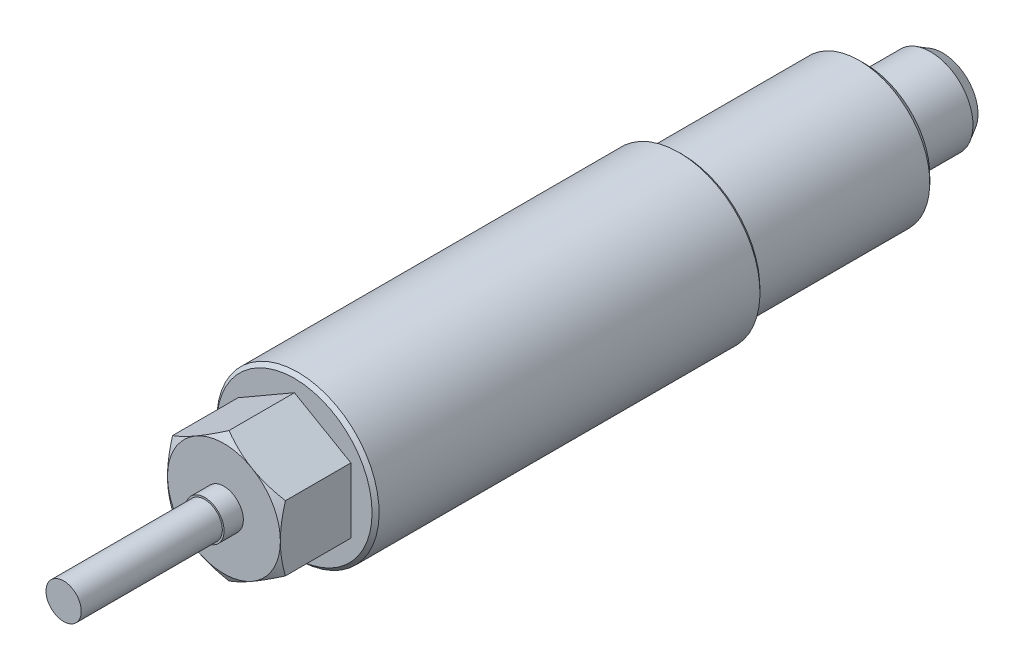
ISO-10303-21;
HEADER;
FILE_DESCRIPTION(('STEP AP214'),'2;1');
FILE_NAME('part.step','',(''),(''),'','','');
FILE_SCHEMA(('AUTOMOTIVE_DESIGN { 1 0 10303 214 1 1 1 1 }'));
ENDSEC;
DATA;
#1=APPLICATION_CONTEXT('core data for automotive mechanical design processes');
#2=APPLICATION_PROTOCOL_DEFINITION('international standard','automotive_design',2000,#1);
#3=PRODUCT_CONTEXT('',#1,'mechanical');
#4=PRODUCT('Part','Part','',(#3));
#5=PRODUCT_RELATED_PRODUCT_CATEGORY('part','',(#4));
#6=PRODUCT_DEFINITION_FORMATION('','',#4);
#7=PRODUCT_DEFINITION_CONTEXT('part definition',#1,'design');
#8=PRODUCT_DEFINITION('design','',#6,#7);
#9=PRODUCT_DEFINITION_SHAPE('','',#8);
#10=(LENGTH_UNIT() NAMED_UNIT(*) SI_UNIT(.MILLI.,.METRE.));
#11=(NAMED_UNIT(*) PLANE_ANGLE_UNIT() SI_UNIT($,.RADIAN.));
#12=(NAMED_UNIT(*) SI_UNIT($,.STERADIAN.) SOLID_ANGLE_UNIT());
#13=UNCERTAINTY_MEASURE_WITH_UNIT(LENGTH_MEASURE(1.E-05),#10,'distance_accuracy_value','');
#14=(GEOMETRIC_REPRESENTATION_CONTEXT(3) GLOBAL_UNCERTAINTY_ASSIGNED_CONTEXT((#13)) GLOBAL_UNIT_ASSIGNED_CONTEXT((#10,
#11,#12)) REPRESENTATION_CONTEXT('',''));
#15=CARTESIAN_POINT('',(0.,0.,0.));
#16=DIRECTION('',(0.,0.,1.));
#17=DIRECTION('',(1.,0.,0.));
#18=AXIS2_PLACEMENT_3D('',#15,#16,#17);
#19=CARTESIAN_POINT('',(0.,0.,81.));
#20=DIRECTION('',(0.,0.,-1.));
#21=DIRECTION('',(0.,1.,0.));
#22=AXIS2_PLACEMENT_3D('',#19,#20,#21);
#23=CONICAL_SURFACE('',#22,11.,0.785398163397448);
#24=CARTESIAN_POINT('',(0.,0.,80.5));
#25=DIRECTION('',(0.,0.,-1.));
#26=DIRECTION('',(0.,1.,0.));
#27=AXIS2_PLACEMENT_3D('',#24,#25,#26);
#28=CIRCLE('',#27,11.5);
#29=CARTESIAN_POINT('',(0.,11.5,80.5));
#30=VERTEX_POINT('',#29);
#31=EDGE_CURVE('E151',#30,#30,#28,.T.);
#32=ORIENTED_EDGE('',*,*,#31,.F.);
#33=EDGE_LOOP('',(#32));
#34=FACE_BOUND('',#33,.T.);
#35=CARTESIAN_POINT('',(0.,0.,81.));
#36=DIRECTION('',(0.,0.,1.));
#37=DIRECTION('',(0.,-1.,0.));
#38=AXIS2_PLACEMENT_3D('',#35,#36,#37);
#39=CIRCLE('',#38,11.);
#40=CARTESIAN_POINT('',(0.,-11.,81.));
#41=VERTEX_POINT('',#40);
#42=EDGE_CURVE('E120',#41,#41,#39,.T.);
#43=ORIENTED_EDGE('',*,*,#42,.F.);
#44=EDGE_LOOP('',(#43));
#45=FACE_BOUND('',#44,.T.);
#46=ADVANCED_FACE('F14',(#34,#45),#23,.T.);
#47=CARTESIAN_POINT('',(0.,0.,0.));
#48=DIRECTION('',(0.,0.,-1.));
#49=DIRECTION('',(0.,1.,0.));
#50=AXIS2_PLACEMENT_3D('',#47,#48,#49);
#51=CYLINDRICAL_SURFACE('',#50,11.5);
#52=CARTESIAN_POINT('',(0.,0.,26.5));
#53=DIRECTION('',(0.,0.,-1.));
#54=DIRECTION('',(0.,1.,0.));
#55=AXIS2_PLACEMENT_3D('',#52,#53,#54);
#56=CIRCLE('',#55,11.5);
#57=CARTESIAN_POINT('',(0.,11.5,26.5));
#58=VERTEX_POINT('',#57);
#59=EDGE_CURVE('E148',#58,#58,#56,.T.);
#60=ORIENTED_EDGE('',*,*,#59,.F.);
#61=EDGE_LOOP('',(#60));
#62=FACE_BOUND('',#61,.T.);
#63=ORIENTED_EDGE('',*,*,#31,.T.);
#64=EDGE_LOOP('',(#63));
#65=FACE_BOUND('',#64,.T.);
#66=ADVANCED_FACE('F218',(#62,#65),#51,.T.);
#67=CARTESIAN_POINT('',(0.,0.,26.5));
#68=DIRECTION('',(0.,0.,1.));
#69=DIRECTION('',(0.,-1.,0.));
#70=AXIS2_PLACEMENT_3D('',#67,#68,#69);
#71=CONICAL_SURFACE('',#70,11.5,0.785398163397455);
#72=CARTESIAN_POINT('',(0.,0.,26.));
#73=DIRECTION('',(0.,0.,-1.));
#74=DIRECTION('',(0.,1.,0.));
#75=AXIS2_PLACEMENT_3D('',#72,#73,#74);
#76=CIRCLE('',#75,11.);
#77=CARTESIAN_POINT('',(0.,11.,26.));
#78=VERTEX_POINT('',#77);
#79=EDGE_CURVE('E145',#78,#78,#76,.T.);
#80=ORIENTED_EDGE('',*,*,#79,.F.);
#81=EDGE_LOOP('',(#80));
#82=FACE_BOUND('',#81,.T.);
#83=ORIENTED_EDGE('',*,*,#59,.T.);
#84=EDGE_LOOP('',(#83));
#85=FACE_BOUND('',#84,.T.);
#86=ADVANCED_FACE('F214',(#82,#85),#71,.T.);
#87=CARTESIAN_POINT('',(11.,0.,26.));
#88=DIRECTION('',(0.,0.,1.));
#89=DIRECTION('',(0.,-1.,0.));
#90=AXIS2_PLACEMENT_3D('',#87,#88,#89);
#91=PLANE('',#90);
#92=CARTESIAN_POINT('',(0.,0.,26.));
#93=DIRECTION('',(0.,0.,-1.));
#94=DIRECTION('',(0.,1.,0.));
#95=AXIS2_PLACEMENT_3D('',#92,#93,#94);
#96=CIRCLE('',#95,10.);
#97=CARTESIAN_POINT('',(0.,10.,26.));
#98=VERTEX_POINT('',#97);
#99=EDGE_CURVE('E142',#98,#98,#96,.T.);
#100=ORIENTED_EDGE('',*,*,#99,.F.);
#101=EDGE_LOOP('',(#100));
#102=FACE_BOUND('',#101,.T.);
#103=ORIENTED_EDGE('',*,*,#79,.T.);
#104=EDGE_LOOP('',(#103));
#105=FACE_BOUND('',#104,.T.);
#106=ADVANCED_FACE('F211',(#102,#105),#91,.F.);
#107=CARTESIAN_POINT('',(-8.,4.61880215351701,81.));
#108=DIRECTION('',(-1.,0.,0.));
#109=DIRECTION('',(0.,-1.,0.));
#110=AXIS2_PLACEMENT_3D('',#107,#108,#109);
#111=PLANE('',#110);
#112=CARTESIAN_POINT('',(-8.,12.5536073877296,87.0243648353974));
#113=CARTESIAN_POINT('',(-8.,12.202944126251,87.1950535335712));
#114=CARTESIAN_POINT('',(-8.,11.851491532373,87.3641476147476));
#115=CARTESIAN_POINT('',(-8.,11.1465884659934,87.6982525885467));
#116=CARTESIAN_POINT('',(-8.,10.7931377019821,87.8632628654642));
#117=CARTESIAN_POINT('',(-8.,10.0820673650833,88.189105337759));
#118=CARTESIAN_POINT('',(-8.,9.72443565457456,88.3499111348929));
#119=CARTESIAN_POINT('',(-8.,9.00637889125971,88.6651358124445));
#120=CARTESIAN_POINT('',(-8.,8.64595396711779,88.8195549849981));
#121=CARTESIAN_POINT('',(-8.,7.90953345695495,89.1253935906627));
#122=CARTESIAN_POINT('',(-8.,7.53342244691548,89.2765365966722));
#123=CARTESIAN_POINT('',(-8.,6.77685561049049,89.5677353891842));
#124=CARTESIAN_POINT('',(-8.,6.39639930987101,89.7077899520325));
#125=CARTESIAN_POINT('',(-8.,5.63119795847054,89.9732419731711));
#126=CARTESIAN_POINT('',(-8.,5.24646288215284,90.0986678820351));
#127=CARTESIAN_POINT('',(-8.,4.47148883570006,90.3309365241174));
#128=CARTESIAN_POINT('',(-8.,4.08125159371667,90.4377849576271));
#129=CARTESIAN_POINT('',(-8.,3.29719320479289,90.6272837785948));
#130=CARTESIAN_POINT('',(-8.,2.90340610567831,90.7100712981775));
#131=CARTESIAN_POINT('',(-8.,2.30902459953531,90.8127022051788));
#132=CARTESIAN_POINT('',(-8.,2.1102670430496,90.8433221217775));
#133=CARTESIAN_POINT('',(-8.,1.71171483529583,90.8967817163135));
#134=CARTESIAN_POINT('',(-8.,1.51192028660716,90.9196221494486));
#135=CARTESIAN_POINT('',(-8.,1.11423554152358,90.9567734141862));
#136=CARTESIAN_POINT('',(-8.,0.916355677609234,90.9711943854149));
#137=CARTESIAN_POINT('',(-8.,0.520162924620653,90.9916487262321));
#138=CARTESIAN_POINT('',(-8.,0.32185004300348,90.9976822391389));
#139=CARTESIAN_POINT('',(-8.,-0.0748530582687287,91.0012171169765));
#140=CARTESIAN_POINT('',(-8.,-0.273243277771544,90.9987184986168));
#141=CARTESIAN_POINT('',(-8.,-0.669738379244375,90.9852520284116));
#142=CARTESIAN_POINT('',(-8.,-0.867843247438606,90.9742837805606));
#143=CARTESIAN_POINT('',(-8.,-1.33957431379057,90.9383175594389));
#144=CARTESIAN_POINT('',(-8.,-1.61291917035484,90.9095444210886));
#145=CARTESIAN_POINT('',(-8.,-2.15766264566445,90.8374103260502));
#146=CARTESIAN_POINT('',(-8.,-2.42906101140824,90.7940475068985));
#147=CARTESIAN_POINT('',(-8.,-3.23998071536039,90.6443668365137));
#148=CARTESIAN_POINT('',(-8.,-3.77594268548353,90.5184813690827));
#149=CARTESIAN_POINT('',(-8.,-4.57753225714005,90.2991318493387));
#150=CARTESIAN_POINT('',(-8.,-4.84728942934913,90.2198813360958));
#151=CARTESIAN_POINT('',(-8.,-5.38418667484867,90.0528836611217));
#152=CARTESIAN_POINT('',(-8.,-5.65132672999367,89.9651364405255));
#153=CARTESIAN_POINT('',(-8.,-6.18306845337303,89.7825750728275));
#154=CARTESIAN_POINT('',(-8.,-6.4476708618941,89.6877630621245));
#155=CARTESIAN_POINT('',(-8.,-6.97466590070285,89.4922140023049));
#156=CARTESIAN_POINT('',(-8.,-7.23705856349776,89.3914770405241));
#157=CARTESIAN_POINT('',(-8.,-7.88051669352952,89.1374262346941));
#158=CARTESIAN_POINT('',(-8.,-8.26047059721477,88.9813014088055));
#159=CARTESIAN_POINT('',(-8.,-9.01691952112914,88.6608599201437));
#160=CARTESIAN_POINT('',(-8.,-9.39341427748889,88.4965426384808));
#161=CARTESIAN_POINT('',(-8.,-10.143629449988,88.1614403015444));
#162=CARTESIAN_POINT('',(-8.,-10.5173490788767,87.9906534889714));
#163=CARTESIAN_POINT('',(-8.,-11.262399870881,87.6439867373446));
#164=CARTESIAN_POINT('',(-8.,-11.6337310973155,87.4681069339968));
#165=CARTESIAN_POINT('',(-8.,-12.3748915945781,87.1120269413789));
#166=CARTESIAN_POINT('',(-8.,-12.7447183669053,86.931821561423));
#167=CARTESIAN_POINT('',(-8.,-13.482727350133,86.5680742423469));
#168=CARTESIAN_POINT('',(-8.,-13.8509095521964,86.3845322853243));
#169=CARTESIAN_POINT('',(-8.,-14.5858360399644,86.0147378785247));
#170=CARTESIAN_POINT('',(-8.,-14.9525805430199,85.8284858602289));
#171=CARTESIAN_POINT('',(-8.,-15.6849051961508,85.4537053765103));
#172=CARTESIAN_POINT('',(-8.,-16.0504853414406,85.2651769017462));
#173=CARTESIAN_POINT('',(-8.,-17.079769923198,84.7309870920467));
#174=CARTESIAN_POINT('',(-8.,-17.7423367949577,84.3831340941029));
#175=CARTESIAN_POINT('',(-8.,-19.0650363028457,83.6827725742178));
#176=CARTESIAN_POINT('',(-8.,-19.7251688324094,83.3302638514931));
#177=CARTESIAN_POINT('',(-8.,-21.0416810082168,82.6227203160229));
#178=CARTESIAN_POINT('',(-8.,-21.6980659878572,82.2676954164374));
#179=CARTESIAN_POINT('',(-8.,-23.0092915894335,81.5549019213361));
#180=CARTESIAN_POINT('',(-8.,-23.6641323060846,81.1971335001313));
#181=CARTESIAN_POINT('',(-8.,-24.3184126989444,80.8383511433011));
#182=B_SPLINE_CURVE_WITH_KNOTS('',3,(#112,#113,#114,#115,#116,#117,#118,#119,#120,#121,#122,
#123,#124,#125,#126,#127,#128,#129,#130,#131,#132,#133,#134,#135,#136,#137,#138,#139,#140,#141,
#142,#143,#144,#145,#146,#147,#148,#149,#150,#151,#152,#153,#154,#155,#156,#157,#158,#159,#160,
#161,#162,#163,#164,#165,#166,#167,#168,#169,#170,#171,#172,#173,#174,#175,#176,#177,#178,#179,
#180,#181),.UNSPECIFIED.,.F.,.F.,(4,2,2,2,2,2,2,2,2,2,2,2,2,2,2,2,2,2,2,2,2,2,2,2,2,2,2,2,2,2,2,
2,2,2,4),(0.,1.17001110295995,2.3401975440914,3.51651067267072,4.69276993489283,
5.90866593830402,7.1246959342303,8.33832003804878,9.55157109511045,10.7577653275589,
11.3609441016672,11.9640643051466,12.5591069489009,13.1541394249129,13.7491707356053,
14.3442298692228,15.1683323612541,15.9925400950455,17.6418068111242,18.485205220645,
19.328609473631,20.1717597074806,21.0148975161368,22.2471030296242,23.479401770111,
24.7120376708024,25.9446407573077,27.178805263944,28.4129763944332,29.646953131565,
30.8809349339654,33.1258942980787,35.3709507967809,37.6096830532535,39.8482742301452),.UNSPECIFIED.);
#183=CARTESIAN_POINT('',(-8.,-4.61880215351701,90.2854688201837));
#184=VERTEX_POINT('',#183);
#185=CARTESIAN_POINT('',(-8.,0.,91.));
#186=VERTEX_POINT('',#185);
#187=EDGE_CURVE('E9',#184,#186,#182,.F.);
#188=ORIENTED_EDGE('',*,*,#187,.T.);
#189=CARTESIAN_POINT('',(-8.,4.61880215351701,90.2854688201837));
#190=VERTEX_POINT('',#189);
#191=EDGE_CURVE('E18',#186,#190,#182,.F.);
#192=ORIENTED_EDGE('',*,*,#191,.T.);
#193=DIRECTION('',(0.,0.,1.));
#194=VECTOR('',#193,1.);
#195=CARTESIAN_POINT('',(-8.,4.61880215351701,81.));
#196=LINE('',#195,#194);
#197=CARTESIAN_POINT('',(-8.,4.61880215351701,81.));
#198=VERTEX_POINT('',#197);
#199=EDGE_CURVE('E111',#198,#190,#196,.T.);
#200=ORIENTED_EDGE('',*,*,#199,.F.);
#201=DIRECTION('',(0.,-1.,0.));
#202=VECTOR('',#201,1.);
#203=CARTESIAN_POINT('',(-8.,4.61880215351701,81.));
#204=LINE('',#203,#202);
#205=CARTESIAN_POINT('',(-8.,-4.61880215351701,81.));
#206=VERTEX_POINT('',#205);
#207=EDGE_CURVE('E97',#198,#206,#204,.T.);
#208=ORIENTED_EDGE('',*,*,#207,.T.);
#209=DIRECTION('',(0.,0.,1.));
#210=VECTOR('',#209,1.);
#211=CARTESIAN_POINT('',(-8.,-4.61880215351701,81.));
#212=LINE('',#211,#210);
#213=EDGE_CURVE('E89',#206,#184,#212,.T.);
#214=ORIENTED_EDGE('',*,*,#213,.T.);
#215=EDGE_LOOP('',(#188,#192,#200,#208,#214));
#216=FACE_BOUND('',#215,.T.);
#217=ADVANCED_FACE('F110',(#216),#111,.T.);
#218=CARTESIAN_POINT('',(0.,9.23760430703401,81.));
#219=DIRECTION('',(-0.5,0.866025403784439,0.));
#220=DIRECTION('',(-0.866025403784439,-0.5,0.));
#221=AXIS2_PLACEMENT_3D('',#218,#219,#220);
#222=PLANE('',#221);
#223=CARTESIAN_POINT('',(-8.0002,4.61868668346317,90.285402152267));
#224=CARTESIAN_POINT('',(-7.82435121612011,4.72021302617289,90.3440092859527));
#225=CARTESIAN_POINT('',(-7.64784680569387,4.82211789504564,90.3999565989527));
#226=CARTESIAN_POINT('',(-7.29340453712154,5.02675523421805,90.5057989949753));
#227=CARTESIAN_POINT('',(-7.11546609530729,5.12948804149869,90.5556914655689));
#228=CARTESIAN_POINT('',(-6.57880176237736,5.43933133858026,90.6953072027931));
#229=CARTESIAN_POINT('',(-6.21795741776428,5.64766491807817,90.7747188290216));
#230=CARTESIAN_POINT('',(-5.67796082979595,5.95943209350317,90.8678383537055));
#231=CARTESIAN_POINT('',(-5.50042181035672,6.06193429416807,90.8943654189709));
#232=CARTESIAN_POINT('',(-5.14454088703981,6.26740224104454,90.9388468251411));
#233=CARTESIAN_POINT('',(-4.96619905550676,6.37036794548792,90.9568019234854));
#234=CARTESIAN_POINT('',(-4.60920831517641,6.57647664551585,90.9836843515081));
#235=CARTESIAN_POINT('',(-4.4305599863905,6.67961930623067,90.9926219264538));
#236=CARTESIAN_POINT('',(-4.07309829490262,6.88599991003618,91.0012776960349));
#237=CARTESIAN_POINT('',(-3.89428493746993,6.98923785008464,91.0009961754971));
#238=CARTESIAN_POINT('',(-3.55998663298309,7.18224506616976,90.9918549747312));
#239=CARTESIAN_POINT('',(-3.40447809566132,7.27202796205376,90.9841103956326));
#240=CARTESIAN_POINT('',(-3.09382523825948,7.45138347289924,90.9617988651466));
#241=CARTESIAN_POINT('',(-2.93868094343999,7.54095607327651,90.9472314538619));
#242=CARTESIAN_POINT('',(-2.47384868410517,7.80932710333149,90.8936393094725));
#243=CARTESIAN_POINT('',(-2.16498351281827,7.98765049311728,90.8447313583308));
#244=CARTESIAN_POINT('',(-1.54397677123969,8.34618890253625,90.7224605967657));
#245=CARTESIAN_POINT('',(-1.23191445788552,8.52635816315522,90.648579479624));
#246=CARTESIAN_POINT('',(-0.612443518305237,8.88400987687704,90.480899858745));
#247=CARTESIAN_POINT('',(-0.305026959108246,9.06149691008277,90.3871407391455));
#248=CARTESIAN_POINT('',(0.000199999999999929,9.23771977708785,90.285402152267));
#249=B_SPLINE_CURVE_WITH_KNOTS('',3,(#223,#224,#225,#226,#227,#228,#229,#230,#231,#232,#233,
#234,#235,#236,#237,#238,#239,#240,#241,#242,#243,#244,#245,#246,#247,#248),.UNSPECIFIED.,.F.,
.F.,(4,2,2,2,2,2,2,2,2,2,2,2,4),(0.,0.633973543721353,1.26821965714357,2.53934712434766,
3.15934343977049,3.77928496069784,4.39852133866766,5.01773858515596,5.5568023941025,
6.09590254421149,7.17487077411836,8.27776850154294,9.37850115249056),.UNSPECIFIED.);
#250=CARTESIAN_POINT('',(-4.,6.92820323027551,91.));
#251=VERTEX_POINT('',#250);
#252=EDGE_CURVE('E257',#190,#251,#249,.T.);
#253=ORIENTED_EDGE('',*,*,#252,.T.);
#254=CARTESIAN_POINT('',(0.,9.23760430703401,90.2854688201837));
#255=VERTEX_POINT('',#254);
#256=EDGE_CURVE('E251',#251,#255,#249,.T.);
#257=ORIENTED_EDGE('',*,*,#256,.T.);
#258=DIRECTION('',(0.,0.,1.));
#259=VECTOR('',#258,1.);
#260=CARTESIAN_POINT('',(0.,9.23760430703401,81.));
#261=LINE('',#260,#259);
#262=CARTESIAN_POINT('',(0.,9.23760430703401,81.));
#263=VERTEX_POINT('',#262);
#264=EDGE_CURVE('E121',#263,#255,#261,.T.);
#265=ORIENTED_EDGE('',*,*,#264,.F.);
#266=DIRECTION('',(-0.866025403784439,-0.5,0.));
#267=VECTOR('',#266,1.);
#268=CARTESIAN_POINT('',(0.,9.23760430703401,81.));
#269=LINE('',#268,#267);
#270=EDGE_CURVE('E113',#263,#198,#269,.T.);
#271=ORIENTED_EDGE('',*,*,#270,.T.);
#272=ORIENTED_EDGE('',*,*,#199,.T.);
#273=EDGE_LOOP('',(#253,#257,#265,#271,#272));
#274=FACE_BOUND('',#273,.T.);
#275=ADVANCED_FACE('F244',(#274),#222,.T.);
#276=CARTESIAN_POINT('',(8.,4.61880215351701,81.));
#277=DIRECTION('',(0.5,0.866025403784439,0.));
#278=DIRECTION('',(-0.866025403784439,0.5,0.));
#279=AXIS2_PLACEMENT_3D('',#276,#277,#278);
#280=PLANE('',#279);
#281=CARTESIAN_POINT('',(-0.0002,9.23771977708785,90.285402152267));
#282=CARTESIAN_POINT('',(0.175648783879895,9.13619343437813,90.3440092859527));
#283=CARTESIAN_POINT('',(0.352153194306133,9.03428856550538,90.3999565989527));
#284=CARTESIAN_POINT('',(0.706595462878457,8.82965122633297,90.5057989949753));
#285=CARTESIAN_POINT('',(0.88453390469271,8.72691841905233,90.5556914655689));
#286=CARTESIAN_POINT('',(1.42119823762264,8.41707512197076,90.6953072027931));
#287=CARTESIAN_POINT('',(1.78204258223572,8.20874154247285,90.7747188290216));
#288=CARTESIAN_POINT('',(2.32203917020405,7.89697436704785,90.8678383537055));
#289=CARTESIAN_POINT('',(2.49957818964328,7.79447216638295,90.8943654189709));
#290=CARTESIAN_POINT('',(2.8554591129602,7.58900421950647,90.9388468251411));
#291=CARTESIAN_POINT('',(3.03380094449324,7.4860385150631,90.9568019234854));
#292=CARTESIAN_POINT('',(3.39079168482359,7.27992981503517,90.9836843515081));
#293=CARTESIAN_POINT('',(3.5694400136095,7.17678715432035,90.9926219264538));
#294=CARTESIAN_POINT('',(3.92690170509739,6.97040655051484,91.0012776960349));
#295=CARTESIAN_POINT('',(4.10571506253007,6.86716861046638,91.0009961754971));
#296=CARTESIAN_POINT('',(4.44001336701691,6.67416139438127,90.9918549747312));
#297=CARTESIAN_POINT('',(4.59552190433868,6.58437849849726,90.9841103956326));
#298=CARTESIAN_POINT('',(4.90617476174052,6.40502298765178,90.9617988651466));
#299=CARTESIAN_POINT('',(5.06131905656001,6.31545038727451,90.9472314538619));
#300=CARTESIAN_POINT('',(5.52615131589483,6.04707935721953,90.8936393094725));
#301=CARTESIAN_POINT('',(5.83501648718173,5.86875596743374,90.8447313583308));
#302=CARTESIAN_POINT('',(6.45602322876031,5.51021755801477,90.7224605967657));
#303=CARTESIAN_POINT('',(6.76808554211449,5.3300482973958,90.648579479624));
#304=CARTESIAN_POINT('',(7.38755648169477,4.97239658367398,90.480899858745));
#305=CARTESIAN_POINT('',(7.69497304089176,4.79490955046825,90.3871407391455));
#306=CARTESIAN_POINT('',(8.0002,4.61868668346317,90.285402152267));
#307=B_SPLINE_CURVE_WITH_KNOTS('',3,(#281,#282,#283,#284,#285,#286,#287,#288,#289,#290,#291,
#292,#293,#294,#295,#296,#297,#298,#299,#300,#301,#302,#303,#304,#305,#306),.UNSPECIFIED.,.F.,
.F.,(4,2,2,2,2,2,2,2,2,2,2,2,4),(0.,0.633973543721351,1.26821965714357,2.53934712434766,
3.15934343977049,3.77928496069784,4.39852133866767,5.01773858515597,5.5568023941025,
6.09590254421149,7.17487077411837,8.27776850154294,9.37850115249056),.UNSPECIFIED.);
#308=CARTESIAN_POINT('',(4.,6.92820323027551,91.));
#309=VERTEX_POINT('',#308);
#310=EDGE_CURVE('E258',#255,#309,#307,.T.);
#311=ORIENTED_EDGE('',*,*,#310,.T.);
#312=CARTESIAN_POINT('',(8.,4.61880215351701,90.2854688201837));
#313=VERTEX_POINT('',#312);
#314=EDGE_CURVE('E259',#309,#313,#307,.T.);
#315=ORIENTED_EDGE('',*,*,#314,.T.);
#316=DIRECTION('',(0.,0.,1.));
#317=VECTOR('',#316,1.);
#318=CARTESIAN_POINT('',(8.,4.61880215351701,81.));
#319=LINE('',#318,#317);
#320=CARTESIAN_POINT('',(8.,4.61880215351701,81.));
#321=VERTEX_POINT('',#320);
#322=EDGE_CURVE('E124',#321,#313,#319,.T.);
#323=ORIENTED_EDGE('',*,*,#322,.F.);
#324=DIRECTION('',(-0.866025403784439,0.5,0.));
#325=VECTOR('',#324,1.);
#326=CARTESIAN_POINT('',(8.,4.61880215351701,81.));
#327=LINE('',#326,#325);
#328=EDGE_CURVE('E115',#321,#263,#327,.T.);
#329=ORIENTED_EDGE('',*,*,#328,.T.);
#330=ORIENTED_EDGE('',*,*,#264,.T.);
#331=EDGE_LOOP('',(#311,#315,#323,#329,#330));
#332=FACE_BOUND('',#331,.T.);
#333=ADVANCED_FACE('F248',(#332),#280,.T.);
#334=CARTESIAN_POINT('',(8.,-4.61880215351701,81.));
#335=DIRECTION('',(1.,0.,0.));
#336=DIRECTION('',(0.,1.,0.));
#337=AXIS2_PLACEMENT_3D('',#334,#335,#336);
#338=PLANE('',#337);
#339=CARTESIAN_POINT('',(8.,12.5536073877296,87.0243648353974));
#340=CARTESIAN_POINT('',(8.,12.202944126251,87.1950535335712));
#341=CARTESIAN_POINT('',(8.,11.851491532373,87.3641476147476));
#342=CARTESIAN_POINT('',(8.,11.1465884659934,87.6982525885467));
#343=CARTESIAN_POINT('',(8.,10.7931377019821,87.8632628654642));
#344=CARTESIAN_POINT('',(8.,10.0820673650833,88.189105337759));
#345=CARTESIAN_POINT('',(8.,9.72443565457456,88.3499111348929));
#346=CARTESIAN_POINT('',(8.,9.00637889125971,88.6651358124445));
#347=CARTESIAN_POINT('',(8.,8.64595396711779,88.8195549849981));
#348=CARTESIAN_POINT('',(8.,7.90953345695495,89.1253935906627));
#349=CARTESIAN_POINT('',(8.,7.53342244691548,89.2765365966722));
#350=CARTESIAN_POINT('',(8.,6.77685561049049,89.5677353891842));
#351=CARTESIAN_POINT('',(8.,6.39639930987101,89.7077899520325));
#352=CARTESIAN_POINT('',(8.,5.63119795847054,89.9732419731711));
#353=CARTESIAN_POINT('',(8.,5.24646288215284,90.0986678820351));
#354=CARTESIAN_POINT('',(8.,4.47148883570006,90.3309365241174));
#355=CARTESIAN_POINT('',(8.,4.08125159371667,90.4377849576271));
#356=CARTESIAN_POINT('',(8.,3.29719320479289,90.6272837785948));
#357=CARTESIAN_POINT('',(8.,2.90340610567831,90.7100712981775));
#358=CARTESIAN_POINT('',(8.,2.30902459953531,90.8127022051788));
#359=CARTESIAN_POINT('',(8.,2.1102670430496,90.8433221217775));
#360=CARTESIAN_POINT('',(8.,1.71171483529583,90.8967817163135));
#361=CARTESIAN_POINT('',(8.,1.51192028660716,90.9196221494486));
#362=CARTESIAN_POINT('',(8.,1.11423554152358,90.9567734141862));
#363=CARTESIAN_POINT('',(8.,0.916355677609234,90.9711943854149));
#364=CARTESIAN_POINT('',(8.,0.520162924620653,90.9916487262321));
#365=CARTESIAN_POINT('',(8.,0.32185004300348,90.9976822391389));
#366=CARTESIAN_POINT('',(8.,-0.0748530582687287,91.0012171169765));
#367=CARTESIAN_POINT('',(8.,-0.273243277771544,90.9987184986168));
#368=CARTESIAN_POINT('',(8.,-0.669738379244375,90.9852520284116));
#369=CARTESIAN_POINT('',(8.,-0.867843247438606,90.9742837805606));
#370=CARTESIAN_POINT('',(8.,-1.33957431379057,90.9383175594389));
#371=CARTESIAN_POINT('',(8.,-1.61291917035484,90.9095444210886));
#372=CARTESIAN_POINT('',(8.,-2.15766264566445,90.8374103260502));
#373=CARTESIAN_POINT('',(8.,-2.42906101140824,90.7940475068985));
#374=CARTESIAN_POINT('',(8.,-3.23998071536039,90.6443668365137));
#375=CARTESIAN_POINT('',(8.,-3.77594268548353,90.5184813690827));
#376=CARTESIAN_POINT('',(8.,-4.57753225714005,90.2991318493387));
#377=CARTESIAN_POINT('',(8.,-4.84728942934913,90.2198813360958));
#378=CARTESIAN_POINT('',(8.,-5.38418667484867,90.0528836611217));
#379=CARTESIAN_POINT('',(8.,-5.65132672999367,89.9651364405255));
#380=CARTESIAN_POINT('',(8.,-6.18306845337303,89.7825750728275));
#381=CARTESIAN_POINT('',(8.,-6.4476708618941,89.6877630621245));
#382=CARTESIAN_POINT('',(8.,-6.97466590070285,89.4922140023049));
#383=CARTESIAN_POINT('',(8.,-7.23705856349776,89.3914770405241));
#384=CARTESIAN_POINT('',(8.,-7.88051669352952,89.1374262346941));
#385=CARTESIAN_POINT('',(8.,-8.26047059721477,88.9813014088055));
#386=CARTESIAN_POINT('',(8.,-9.01691952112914,88.6608599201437));
#387=CARTESIAN_POINT('',(8.,-9.39341427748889,88.4965426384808));
#388=CARTESIAN_POINT('',(8.,-10.143629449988,88.1614403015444));
#389=CARTESIAN_POINT('',(8.,-10.5173490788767,87.9906534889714));
#390=CARTESIAN_POINT('',(8.,-11.262399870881,87.6439867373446));
#391=CARTESIAN_POINT('',(8.,-11.6337310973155,87.4681069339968));
#392=CARTESIAN_POINT('',(8.,-12.3748915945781,87.1120269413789));
#393=CARTESIAN_POINT('',(8.,-12.7447183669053,86.931821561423));
#394=CARTESIAN_POINT('',(8.,-13.482727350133,86.5680742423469));
#395=CARTESIAN_POINT('',(8.,-13.8509095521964,86.3845322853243));
#396=CARTESIAN_POINT('',(8.,-14.5858360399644,86.0147378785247));
#397=CARTESIAN_POINT('',(8.,-14.9525805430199,85.8284858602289));
#398=CARTESIAN_POINT('',(8.,-15.6849051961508,85.4537053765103));
#399=CARTESIAN_POINT('',(8.,-16.0504853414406,85.2651769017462));
#400=CARTESIAN_POINT('',(8.,-17.079769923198,84.7309870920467));
#401=CARTESIAN_POINT('',(8.,-17.7423367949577,84.3831340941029));
#402=CARTESIAN_POINT('',(8.,-19.0650363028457,83.6827725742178));
#403=CARTESIAN_POINT('',(8.,-19.7251688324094,83.3302638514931));
#404=CARTESIAN_POINT('',(8.,-21.0416810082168,82.6227203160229));
#405=CARTESIAN_POINT('',(8.,-21.6980659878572,82.2676954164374));
#406=CARTESIAN_POINT('',(8.,-23.0092915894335,81.5549019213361));
#407=CARTESIAN_POINT('',(8.,-23.6641323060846,81.1971335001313));
#408=CARTESIAN_POINT('',(8.,-24.3184126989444,80.8383511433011));
#409=B_SPLINE_CURVE_WITH_KNOTS('',3,(#339,#340,#341,#342,#343,#344,#345,#346,#347,#348,#349,
#350,#351,#352,#353,#354,#355,#356,#357,#358,#359,#360,#361,#362,#363,#364,#365,#366,#367,#368,
#369,#370,#371,#372,#373,#374,#375,#376,#377,#378,#379,#380,#381,#382,#383,#384,#385,#386,#387,
#388,#389,#390,#391,#392,#393,#394,#395,#396,#397,#398,#399,#400,#401,#402,#403,#404,#405,#406,
#407,#408),.UNSPECIFIED.,.F.,.F.,(4,2,2,2,2,2,2,2,2,2,2,2,2,2,2,2,2,2,2,2,2,2,2,2,2,2,2,2,2,2,2,
2,2,2,4),(0.,1.17001110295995,2.3401975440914,3.51651067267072,4.69276993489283,
5.90866593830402,7.1246959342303,8.33832003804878,9.55157109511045,10.7577653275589,
11.3609441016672,11.9640643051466,12.5591069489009,13.1541394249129,13.7491707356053,
14.3442298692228,15.1683323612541,15.9925400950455,17.6418068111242,18.485205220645,
19.328609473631,20.1717597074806,21.0148975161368,22.2471030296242,23.479401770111,
24.7120376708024,25.9446407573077,27.178805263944,28.4129763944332,29.646953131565,
30.8809349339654,33.1258942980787,35.3709507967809,37.6096830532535,39.8482742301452),.UNSPECIFIED.);
#410=CARTESIAN_POINT('',(8.,0.,91.));
#411=VERTEX_POINT('',#410);
#412=EDGE_CURVE('E264',#313,#411,#409,.T.);
#413=ORIENTED_EDGE('',*,*,#412,.T.);
#414=CARTESIAN_POINT('',(8.,-4.61880215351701,90.2854688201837));
#415=VERTEX_POINT('',#414);
#416=EDGE_CURVE('E265',#411,#415,#409,.T.);
#417=ORIENTED_EDGE('',*,*,#416,.T.);
#418=DIRECTION('',(0.,0.,1.));
#419=VECTOR('',#418,1.);
#420=CARTESIAN_POINT('',(8.,-4.61880215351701,81.));
#421=LINE('',#420,#419);
#422=CARTESIAN_POINT('',(8.,-4.61880215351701,81.));
#423=VERTEX_POINT('',#422);
#424=EDGE_CURVE('E127',#423,#415,#421,.T.);
#425=ORIENTED_EDGE('',*,*,#424,.F.);
#426=DIRECTION('',(0.,1.,0.));
#427=VECTOR('',#426,1.);
#428=CARTESIAN_POINT('',(8.,-4.61880215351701,81.));
#429=LINE('',#428,#427);
#430=EDGE_CURVE('E319',#423,#321,#429,.T.);
#431=ORIENTED_EDGE('',*,*,#430,.T.);
#432=ORIENTED_EDGE('',*,*,#322,.T.);
#433=EDGE_LOOP('',(#413,#417,#425,#431,#432));
#434=FACE_BOUND('',#433,.T.);
#435=ADVANCED_FACE('F271',(#434),#338,.T.);
#436=CARTESIAN_POINT('',(0.,-9.23760430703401,81.));
#437=DIRECTION('',(0.5,-0.866025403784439,0.));
#438=DIRECTION('',(0.866025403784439,0.5,0.));
#439=AXIS2_PLACEMENT_3D('',#436,#437,#438);
#440=PLANE('',#439);
#441=CARTESIAN_POINT('',(8.0002,-4.61868668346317,90.285402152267));
#442=CARTESIAN_POINT('',(7.82435121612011,-4.72021302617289,90.3440092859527));
#443=CARTESIAN_POINT('',(7.64784680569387,-4.82211789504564,90.3999565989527));
#444=CARTESIAN_POINT('',(7.29340453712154,-5.02675523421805,90.5057989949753));
#445=CARTESIAN_POINT('',(7.11546609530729,-5.12948804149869,90.5556914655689));
#446=CARTESIAN_POINT('',(6.57880176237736,-5.43933133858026,90.6953072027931));
#447=CARTESIAN_POINT('',(6.21795741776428,-5.64766491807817,90.7747188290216));
#448=CARTESIAN_POINT('',(5.67796082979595,-5.95943209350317,90.8678383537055));
#449=CARTESIAN_POINT('',(5.50042181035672,-6.06193429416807,90.8943654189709));
#450=CARTESIAN_POINT('',(5.14454088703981,-6.26740224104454,90.9388468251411));
#451=CARTESIAN_POINT('',(4.96619905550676,-6.37036794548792,90.9568019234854));
#452=CARTESIAN_POINT('',(4.60920831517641,-6.57647664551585,90.9836843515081));
#453=CARTESIAN_POINT('',(4.4305599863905,-6.67961930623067,90.9926219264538));
#454=CARTESIAN_POINT('',(4.07309829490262,-6.88599991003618,91.0012776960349));
#455=CARTESIAN_POINT('',(3.89428493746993,-6.98923785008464,91.0009961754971));
#456=CARTESIAN_POINT('',(3.55998663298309,-7.18224506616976,90.9918549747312));
#457=CARTESIAN_POINT('',(3.40447809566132,-7.27202796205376,90.9841103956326));
#458=CARTESIAN_POINT('',(3.09382523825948,-7.45138347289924,90.9617988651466));
#459=CARTESIAN_POINT('',(2.93868094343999,-7.54095607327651,90.9472314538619));
#460=CARTESIAN_POINT('',(2.47384868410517,-7.80932710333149,90.8936393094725));
#461=CARTESIAN_POINT('',(2.16498351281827,-7.98765049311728,90.8447313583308));
#462=CARTESIAN_POINT('',(1.54397677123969,-8.34618890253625,90.7224605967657));
#463=CARTESIAN_POINT('',(1.23191445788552,-8.52635816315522,90.648579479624));
#464=CARTESIAN_POINT('',(0.612443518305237,-8.88400987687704,90.480899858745));
#465=CARTESIAN_POINT('',(0.305026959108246,-9.06149691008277,90.3871407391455));
#466=CARTESIAN_POINT('',(-0.000199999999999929,-9.23771977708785,90.285402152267));
#467=B_SPLINE_CURVE_WITH_KNOTS('',3,(#441,#442,#443,#444,#445,#446,#447,#448,#449,#450,#451,
#452,#453,#454,#455,#456,#457,#458,#459,#460,#461,#462,#463,#464,#465,#466),.UNSPECIFIED.,.F.,
.F.,(4,2,2,2,2,2,2,2,2,2,2,2,4),(0.,0.633973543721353,1.26821965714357,2.53934712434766,
3.15934343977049,3.77928496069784,4.39852133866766,5.01773858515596,5.5568023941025,
6.09590254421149,7.17487077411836,8.27776850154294,9.37850115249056),.UNSPECIFIED.);
#468=CARTESIAN_POINT('',(4.,-6.92820323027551,91.));
#469=VERTEX_POINT('',#468);
#470=EDGE_CURVE('E270',#415,#469,#467,.T.);
#471=ORIENTED_EDGE('',*,*,#470,.T.);
#472=CARTESIAN_POINT('',(0.,-9.23760430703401,90.2854688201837));
#473=VERTEX_POINT('',#472);
#474=EDGE_CURVE('E177',#469,#473,#467,.T.);
#475=ORIENTED_EDGE('',*,*,#474,.T.);
#476=DIRECTION('',(0.,0.,1.));
#477=VECTOR('',#476,1.);
#478=CARTESIAN_POINT('',(0.,-9.23760430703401,81.));
#479=LINE('',#478,#477);
#480=CARTESIAN_POINT('',(0.,-9.23760430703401,81.));
#481=VERTEX_POINT('',#480);
#482=EDGE_CURVE('E96',#481,#473,#479,.T.);
#483=ORIENTED_EDGE('',*,*,#482,.F.);
#484=DIRECTION('',(0.866025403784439,0.5,0.));
#485=VECTOR('',#484,1.);
#486=CARTESIAN_POINT('',(0.,-9.23760430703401,81.));
#487=LINE('',#486,#485);
#488=EDGE_CURVE('E107',#481,#423,#487,.T.);
#489=ORIENTED_EDGE('',*,*,#488,.T.);
#490=ORIENTED_EDGE('',*,*,#424,.T.);
#491=EDGE_LOOP('',(#471,#475,#483,#489,#490));
#492=FACE_BOUND('',#491,.T.);
#493=ADVANCED_FACE('F191',(#492),#440,.T.);
#494=CARTESIAN_POINT('',(-8.,-4.61880215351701,81.));
#495=DIRECTION('',(-0.5,-0.866025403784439,0.));
#496=DIRECTION('',(0.866025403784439,-0.5,0.));
#497=AXIS2_PLACEMENT_3D('',#494,#495,#496);
#498=PLANE('',#497);
#499=CARTESIAN_POINT('',(0.0002,-9.23771977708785,90.285402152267));
#500=CARTESIAN_POINT('',(-0.175648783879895,-9.13619343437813,90.3440092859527));
#501=CARTESIAN_POINT('',(-0.352153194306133,-9.03428856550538,90.3999565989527));
#502=CARTESIAN_POINT('',(-0.706595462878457,-8.82965122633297,90.5057989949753));
#503=CARTESIAN_POINT('',(-0.88453390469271,-8.72691841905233,90.5556914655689));
#504=CARTESIAN_POINT('',(-1.42119823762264,-8.41707512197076,90.6953072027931));
#505=CARTESIAN_POINT('',(-1.78204258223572,-8.20874154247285,90.7747188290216));
#506=CARTESIAN_POINT('',(-2.32203917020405,-7.89697436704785,90.8678383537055));
#507=CARTESIAN_POINT('',(-2.49957818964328,-7.79447216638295,90.8943654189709));
#508=CARTESIAN_POINT('',(-2.8554591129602,-7.58900421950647,90.9388468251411));
#509=CARTESIAN_POINT('',(-3.03380094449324,-7.4860385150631,90.9568019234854));
#510=CARTESIAN_POINT('',(-3.39079168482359,-7.27992981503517,90.9836843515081));
#511=CARTESIAN_POINT('',(-3.5694400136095,-7.17678715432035,90.9926219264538));
#512=CARTESIAN_POINT('',(-3.92690170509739,-6.97040655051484,91.0012776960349));
#513=CARTESIAN_POINT('',(-4.10571506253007,-6.86716861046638,91.0009961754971));
#514=CARTESIAN_POINT('',(-4.44001336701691,-6.67416139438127,90.9918549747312));
#515=CARTESIAN_POINT('',(-4.59552190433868,-6.58437849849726,90.9841103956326));
#516=CARTESIAN_POINT('',(-4.90617476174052,-6.40502298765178,90.9617988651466));
#517=CARTESIAN_POINT('',(-5.06131905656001,-6.31545038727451,90.9472314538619));
#518=CARTESIAN_POINT('',(-5.52615131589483,-6.04707935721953,90.8936393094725));
#519=CARTESIAN_POINT('',(-5.83501648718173,-5.86875596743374,90.8447313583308));
#520=CARTESIAN_POINT('',(-6.45602322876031,-5.51021755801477,90.7224605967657));
#521=CARTESIAN_POINT('',(-6.76808554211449,-5.3300482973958,90.648579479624));
#522=CARTESIAN_POINT('',(-7.38755648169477,-4.97239658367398,90.480899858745));
#523=CARTESIAN_POINT('',(-7.69497304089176,-4.79490955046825,90.3871407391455));
#524=CARTESIAN_POINT('',(-8.0002,-4.61868668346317,90.285402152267));
#525=B_SPLINE_CURVE_WITH_KNOTS('',3,(#499,#500,#501,#502,#503,#504,#505,#506,#507,#508,#509,
#510,#511,#512,#513,#514,#515,#516,#517,#518,#519,#520,#521,#522,#523,#524),.UNSPECIFIED.,.F.,
.F.,(4,2,2,2,2,2,2,2,2,2,2,2,4),(0.,0.633973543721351,1.26821965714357,2.53934712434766,
3.15934343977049,3.77928496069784,4.39852133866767,5.01773858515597,5.5568023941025,
6.09590254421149,7.17487077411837,8.27776850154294,9.37850115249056),.UNSPECIFIED.);
#526=CARTESIAN_POINT('',(-4.,-6.92820323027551,91.));
#527=VERTEX_POINT('',#526);
#528=EDGE_CURVE('E35',#473,#527,#525,.T.);
#529=ORIENTED_EDGE('',*,*,#528,.T.);
#530=EDGE_CURVE('E93',#527,#184,#525,.T.);
#531=ORIENTED_EDGE('',*,*,#530,.T.);
#532=ORIENTED_EDGE('',*,*,#213,.F.);
#533=DIRECTION('',(0.866025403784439,-0.5,0.));
#534=VECTOR('',#533,1.);
#535=CARTESIAN_POINT('',(-8.,-4.61880215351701,81.));
#536=LINE('',#535,#534);
#537=EDGE_CURVE('E92',#206,#481,#536,.T.);
#538=ORIENTED_EDGE('',*,*,#537,.T.);
#539=ORIENTED_EDGE('',*,*,#482,.T.);
#540=EDGE_LOOP('',(#529,#531,#532,#538,#539));
#541=FACE_BOUND('',#540,.T.);
#542=ADVANCED_FACE('F91',(#541),#498,.T.);
#543=CARTESIAN_POINT('',(0.,0.,81.));
#544=DIRECTION('',(0.,0.,1.));
#545=DIRECTION('',(0.,-1.,0.));
#546=AXIS2_PLACEMENT_3D('',#543,#544,#545);
#547=PLANE('',#546);
#548=ORIENTED_EDGE('',*,*,#207,.F.);
#549=ORIENTED_EDGE('',*,*,#270,.F.);
#550=ORIENTED_EDGE('',*,*,#328,.F.);
#551=ORIENTED_EDGE('',*,*,#430,.F.);
#552=ORIENTED_EDGE('',*,*,#488,.F.);
#553=ORIENTED_EDGE('',*,*,#537,.F.);
#554=EDGE_LOOP('',(#548,#549,#550,#551,#552,#553));
#555=FACE_BOUND('',#554,.T.);
#556=ORIENTED_EDGE('',*,*,#42,.T.);
#557=EDGE_LOOP('',(#556));
#558=FACE_BOUND('',#557,.T.);
#559=ADVANCED_FACE('F102',(#555,#558),#547,.T.);
#560=CARTESIAN_POINT('',(0.,0.,113.73));
#561=DIRECTION('',(0.,0.,-1.));
#562=DIRECTION('',(0.,1.,0.));
#563=AXIS2_PLACEMENT_3D('',#560,#561,#562);
#564=PLANE('',#563);
#565=CARTESIAN_POINT('',(0.,0.,113.73));
#566=DIRECTION('',(0.,0.,-1.));
#567=DIRECTION('',(0.,1.,0.));
#568=AXIS2_PLACEMENT_3D('',#565,#566,#567);
#569=CIRCLE('',#568,2.5);
#570=CARTESIAN_POINT('',(0.,2.5,113.73));
#571=VERTEX_POINT('',#570);
#572=EDGE_CURVE('E168',#571,#571,#569,.T.);
#573=ORIENTED_EDGE('',*,*,#572,.F.);
#574=EDGE_LOOP('',(#573));
#575=FACE_BOUND('',#574,.T.);
#576=ADVANCED_FACE('F16',(#575),#564,.F.);
#577=CARTESIAN_POINT('',(0.,0.,0.));
#578=DIRECTION('',(0.,0.,-1.));
#579=DIRECTION('',(0.,1.,0.));
#580=AXIS2_PLACEMENT_3D('',#577,#578,#579);
#581=CYLINDRICAL_SURFACE('',#580,2.5);
#582=CARTESIAN_POINT('',(0.,0.,93.73));
#583=DIRECTION('',(0.,0.,-1.));
#584=DIRECTION('',(0.,1.,0.));
#585=AXIS2_PLACEMENT_3D('',#582,#583,#584);
#586=CIRCLE('',#585,2.5);
#587=CARTESIAN_POINT('',(0.,2.5,93.73));
#588=VERTEX_POINT('',#587);
#589=EDGE_CURVE('E165',#588,#588,#586,.T.);
#590=ORIENTED_EDGE('',*,*,#589,.F.);
#591=EDGE_LOOP('',(#590));
#592=FACE_BOUND('',#591,.T.);
#593=ORIENTED_EDGE('',*,*,#572,.T.);
#594=EDGE_LOOP('',(#593));
#595=FACE_BOUND('',#594,.T.);
#596=ADVANCED_FACE('F237',(#592,#595),#581,.T.);
#597=CARTESIAN_POINT('',(2.5,0.,93.73));
#598=DIRECTION('',(0.,0.,-1.));
#599=DIRECTION('',(0.,1.,0.));
#600=AXIS2_PLACEMENT_3D('',#597,#598,#599);
#601=PLANE('',#600);
#602=CARTESIAN_POINT('',(0.,0.,93.73));
#603=DIRECTION('',(0.,0.,-1.));
#604=DIRECTION('',(0.,1.,0.));
#605=AXIS2_PLACEMENT_3D('',#602,#603,#604);
#606=CIRCLE('',#605,2.75);
#607=CARTESIAN_POINT('',(0.,2.75,93.73));
#608=VERTEX_POINT('',#607);
#609=EDGE_CURVE('E162',#608,#608,#606,.T.);
#610=ORIENTED_EDGE('',*,*,#609,.F.);
#611=EDGE_LOOP('',(#610));
#612=FACE_BOUND('',#611,.T.);
#613=ORIENTED_EDGE('',*,*,#589,.T.);
#614=EDGE_LOOP('',(#613));
#615=FACE_BOUND('',#614,.T.);
#616=ADVANCED_FACE('F591',(#612,#615),#601,.F.);
#617=CARTESIAN_POINT('',(0.,0.,0.));
#618=DIRECTION('',(0.,0.,-1.));
#619=DIRECTION('',(0.,1.,0.));
#620=AXIS2_PLACEMENT_3D('',#617,#618,#619);
#621=CYLINDRICAL_SURFACE('',#620,2.75);
#622=CARTESIAN_POINT('',(0.,0.,91.));
#623=DIRECTION('',(0.,0.,-1.));
#624=DIRECTION('',(0.,1.,0.));
#625=AXIS2_PLACEMENT_3D('',#622,#623,#624);
#626=CIRCLE('',#625,2.75);
#627=CARTESIAN_POINT('',(0.,2.75,91.));
#628=VERTEX_POINT('',#627);
#629=EDGE_CURVE('E158',#628,#628,#626,.T.);
#630=ORIENTED_EDGE('',*,*,#629,.F.);
#631=EDGE_LOOP('',(#630));
#632=FACE_BOUND('',#631,.T.);
#633=ORIENTED_EDGE('',*,*,#609,.T.);
#634=EDGE_LOOP('',(#633));
#635=FACE_BOUND('',#634,.T.);
#636=ADVANCED_FACE('F584',(#632,#635),#621,.T.);
#637=CARTESIAN_POINT('',(0.,0.,91.));
#638=DIRECTION('',(0.,0.,-1.));
#639=DIRECTION('',(0.,1.,0.));
#640=AXIS2_PLACEMENT_3D('',#637,#638,#639);
#641=CONICAL_SURFACE('',#640,8.,1.0471975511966);
#642=ORIENTED_EDGE('',*,*,#416,.F.);
#643=CARTESIAN_POINT('',(0.,0.,91.));
#644=DIRECTION('',(0.,0.,-1.));
#645=DIRECTION('',(0.,1.,0.));
#646=AXIS2_PLACEMENT_3D('',#643,#644,#645);
#647=CIRCLE('',#646,8.);
#648=EDGE_CURVE('E155',#411,#469,#647,.T.);
#649=ORIENTED_EDGE('',*,*,#648,.T.);
#650=ORIENTED_EDGE('',*,*,#470,.F.);
#651=EDGE_LOOP('',(#642,#649,#650));
#652=FACE_BOUND('',#651,.T.);
#653=ADVANCED_FACE('F290',(#652),#641,.T.);
#654=ORIENTED_EDGE('',*,*,#474,.F.);
#655=EDGE_CURVE('E159',#469,#527,#647,.T.);
#656=ORIENTED_EDGE('',*,*,#655,.T.);
#657=ORIENTED_EDGE('',*,*,#528,.F.);
#658=EDGE_LOOP('',(#654,#656,#657));
#659=FACE_BOUND('',#658,.T.);
#660=ADVANCED_FACE('F547',(#659),#641,.T.);
#661=ORIENTED_EDGE('',*,*,#191,.F.);
#662=EDGE_CURVE('E308',#186,#251,#647,.T.);
#663=ORIENTED_EDGE('',*,*,#662,.T.);
#664=ORIENTED_EDGE('',*,*,#252,.F.);
#665=EDGE_LOOP('',(#661,#663,#664));
#666=FACE_BOUND('',#665,.T.);
#667=ADVANCED_FACE('F546',(#666),#641,.T.);
#668=ORIENTED_EDGE('',*,*,#256,.F.);
#669=EDGE_CURVE('E297',#251,#309,#647,.T.);
#670=ORIENTED_EDGE('',*,*,#669,.T.);
#671=ORIENTED_EDGE('',*,*,#310,.F.);
#672=EDGE_LOOP('',(#668,#670,#671));
#673=FACE_BOUND('',#672,.T.);
#674=ADVANCED_FACE('F316',(#673),#641,.T.);
#675=ORIENTED_EDGE('',*,*,#314,.F.);
#676=EDGE_CURVE('E154',#309,#411,#647,.T.);
#677=ORIENTED_EDGE('',*,*,#676,.T.);
#678=ORIENTED_EDGE('',*,*,#412,.F.);
#679=EDGE_LOOP('',(#675,#677,#678));
#680=FACE_BOUND('',#679,.T.);
#681=ADVANCED_FACE('F293',(#680),#641,.T.);
#682=CARTESIAN_POINT('',(2.75,0.,91.));
#683=DIRECTION('',(0.,0.,-1.));
#684=DIRECTION('',(0.,1.,0.));
#685=AXIS2_PLACEMENT_3D('',#682,#683,#684);
#686=PLANE('',#685);
#687=ORIENTED_EDGE('',*,*,#648,.F.);
#688=ORIENTED_EDGE('',*,*,#676,.F.);
#689=ORIENTED_EDGE('',*,*,#669,.F.);
#690=ORIENTED_EDGE('',*,*,#662,.F.);
#691=EDGE_CURVE('E305',#527,#186,#647,.T.);
#692=ORIENTED_EDGE('',*,*,#691,.F.);
#693=ORIENTED_EDGE('',*,*,#655,.F.);
#694=EDGE_LOOP('',(#687,#688,#689,#690,#692,#693));
#695=FACE_BOUND('',#694,.T.);
#696=ORIENTED_EDGE('',*,*,#629,.T.);
#697=EDGE_LOOP('',(#696));
#698=FACE_BOUND('',#697,.T.);
#699=ADVANCED_FACE('F299',(#695,#698),#686,.F.);
#700=ORIENTED_EDGE('',*,*,#187,.F.);
#701=ORIENTED_EDGE('',*,*,#530,.F.);
#702=ORIENTED_EDGE('',*,*,#691,.T.);
#703=EDGE_LOOP('',(#700,#701,#702));
#704=FACE_BOUND('',#703,.T.);
#705=ADVANCED_FACE('F184',(#704),#641,.T.);
#706=CARTESIAN_POINT('',(0.,0.,0.));
#707=DIRECTION('',(0.,0.,-1.));
#708=DIRECTION('',(-1.,0.,0.));
#709=AXIS2_PLACEMENT_3D('',#706,#707,#708);
#710=SPHERICAL_SURFACE('',#709,12.);
#711=CARTESIAN_POINT('',(0.,0.,-10.9002881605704));
#712=DIRECTION('',(0.,0.,-1.));
#713=DIRECTION('',(0.,1.,0.));
#714=AXIS2_PLACEMENT_3D('',#711,#712,#713);
#715=CIRCLE('',#714,5.01833817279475);
#716=CARTESIAN_POINT('',(0.,5.01833817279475,-10.9002881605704));
#717=VERTEX_POINT('',#716);
#718=EDGE_CURVE('E343',#717,#717,#715,.T.);
#719=ORIENTED_EDGE('',*,*,#718,.T.);
#720=EDGE_LOOP('',(#719));
#721=FACE_BOUND('',#720,.T.);
#722=ADVANCED_FACE('F347',(#721),#710,.T.);
#723=CARTESIAN_POINT('',(0.,0.,-9.2));
#724=DIRECTION('',(0.,0.,1.));
#725=DIRECTION('',(0.,-1.,0.));
#726=AXIS2_PLACEMENT_3D('',#723,#724,#725);
#727=CONICAL_SURFACE('',#726,6.,0.523598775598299);
#728=ORIENTED_EDGE('',*,*,#718,.F.);
#729=EDGE_LOOP('',(#728));
#730=FACE_BOUND('',#729,.T.);
#731=CARTESIAN_POINT('',(0.,0.,-9.2));
#732=DIRECTION('',(0.,0.,-1.));
#733=DIRECTION('',(0.,1.,0.));
#734=AXIS2_PLACEMENT_3D('',#731,#732,#733);
#735=CIRCLE('',#734,6.);
#736=CARTESIAN_POINT('',(0.,6.,-9.2));
#737=VERTEX_POINT('',#736);
#738=EDGE_CURVE('E340',#737,#737,#735,.T.);
#739=ORIENTED_EDGE('',*,*,#738,.T.);
#740=EDGE_LOOP('',(#739));
#741=FACE_BOUND('',#740,.T.);
#742=ADVANCED_FACE('F349',(#730,#741),#727,.T.);
#743=CARTESIAN_POINT('',(0.,0.,-12.));
#744=DIRECTION('',(0.,0.,-1.));
#745=DIRECTION('',(0.,1.,0.));
#746=AXIS2_PLACEMENT_3D('',#743,#744,#745);
#747=CYLINDRICAL_SURFACE('',#746,6.);
#748=ORIENTED_EDGE('',*,*,#738,.F.);
#749=EDGE_LOOP('',(#748));
#750=FACE_BOUND('',#749,.T.);
#751=CARTESIAN_POINT('',(0.,0.,-0.5));
#752=DIRECTION('',(0.,0.,-1.));
#753=DIRECTION('',(0.,1.,0.));
#754=AXIS2_PLACEMENT_3D('',#751,#752,#753);
#755=CIRCLE('',#754,6.);
#756=CARTESIAN_POINT('',(0.,6.,-0.5));
#757=VERTEX_POINT('',#756);
#758=EDGE_CURVE('E337',#757,#757,#755,.T.);
#759=ORIENTED_EDGE('',*,*,#758,.T.);
#760=EDGE_LOOP('',(#759));
#761=FACE_BOUND('',#760,.T.);
#762=ADVANCED_FACE('F352',(#750,#761),#747,.T.);
#763=CARTESIAN_POINT('',(0.,0.,-0.326794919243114));
#764=DIRECTION('',(0.,0.,-1.));
#765=DIRECTION('',(0.,1.,0.));
#766=AXIS2_PLACEMENT_3D('',#763,#764,#765);
#767=CONICAL_SURFACE('',#766,5.9,0.5235987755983);
#768=ORIENTED_EDGE('',*,*,#758,.F.);
#769=EDGE_LOOP('',(#768));
#770=FACE_BOUND('',#769,.T.);
#771=CARTESIAN_POINT('',(0.,0.,-0.326794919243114));
#772=DIRECTION('',(0.,0.,-1.));
#773=DIRECTION('',(0.,1.,0.));
#774=AXIS2_PLACEMENT_3D('',#771,#772,#773);
#775=CIRCLE('',#774,5.9);
#776=CARTESIAN_POINT('',(0.,5.9,-0.326794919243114));
#777=VERTEX_POINT('',#776);
#778=EDGE_CURVE('E334',#777,#777,#775,.T.);
#779=ORIENTED_EDGE('',*,*,#778,.T.);
#780=EDGE_LOOP('',(#779));
#781=FACE_BOUND('',#780,.T.);
#782=ADVANCED_FACE('F358',(#770,#781),#767,.T.);
#783=CARTESIAN_POINT('',(0.,0.,-12.));
#784=DIRECTION('',(0.,0.,-1.));
#785=DIRECTION('',(0.,1.,0.));
#786=AXIS2_PLACEMENT_3D('',#783,#784,#785);
#787=CYLINDRICAL_SURFACE('',#786,5.9);
#788=ORIENTED_EDGE('',*,*,#778,.F.);
#789=EDGE_LOOP('',(#788));
#790=FACE_BOUND('',#789,.T.);
#791=CARTESIAN_POINT('',(0.,0.,-0.25));
#792=DIRECTION('',(0.,0.,-1.));
#793=DIRECTION('',(0.,1.,0.));
#794=AXIS2_PLACEMENT_3D('',#791,#792,#793);
#795=CIRCLE('',#794,5.9);
#796=CARTESIAN_POINT('',(0.,5.9,-0.25));
#797=VERTEX_POINT('',#796);
#798=EDGE_CURVE('E331',#797,#797,#795,.T.);
#799=ORIENTED_EDGE('',*,*,#798,.T.);
#800=EDGE_LOOP('',(#799));
#801=FACE_BOUND('',#800,.T.);
#802=ADVANCED_FACE('F364',(#790,#801),#787,.T.);
#803=CARTESIAN_POINT('',(0.,0.,-0.25));
#804=DIRECTION('',(0.,0.,-1.));
#805=DIRECTION('',(0.,1.,0.));
#806=AXIS2_PLACEMENT_3D('',#803,#804,#805);
#807=TOROIDAL_SURFACE('',#806,6.15,0.25);
#808=ORIENTED_EDGE('',*,*,#798,.F.);
#809=EDGE_LOOP('',(#808));
#810=FACE_BOUND('',#809,.T.);
#811=CARTESIAN_POINT('',(0.,0.,0.));
#812=DIRECTION('',(0.,0.,-1.));
#813=DIRECTION('',(0.,1.,0.));
#814=AXIS2_PLACEMENT_3D('',#811,#812,#813);
#815=CIRCLE('',#814,6.15);
#816=CARTESIAN_POINT('',(0.,6.15,0.));
#817=VERTEX_POINT('',#816);
#818=EDGE_CURVE('E328',#817,#817,#815,.T.);
#819=ORIENTED_EDGE('',*,*,#818,.T.);
#820=EDGE_LOOP('',(#819));
#821=FACE_BOUND('',#820,.T.);
#822=ADVANCED_FACE('F370',(#810,#821),#807,.F.);
#823=CARTESIAN_POINT('',(6.2,0.,0.));
#824=DIRECTION('',(0.,0.,1.));
#825=DIRECTION('',(0.,-1.,0.));
#826=AXIS2_PLACEMENT_3D('',#823,#824,#825);
#827=PLANE('',#826);
#828=ORIENTED_EDGE('',*,*,#818,.F.);
#829=EDGE_LOOP('',(#828));
#830=FACE_BOUND('',#829,.T.);
#831=CARTESIAN_POINT('',(0.,0.,0.));
#832=DIRECTION('',(0.,0.,-1.));
#833=DIRECTION('',(0.,1.,0.));
#834=AXIS2_PLACEMENT_3D('',#831,#832,#833);
#835=CIRCLE('',#834,6.2);
#836=CARTESIAN_POINT('',(0.,6.2,0.));
#837=VERTEX_POINT('',#836);
#838=EDGE_CURVE('E325',#837,#837,#835,.T.);
#839=ORIENTED_EDGE('',*,*,#838,.T.);
#840=EDGE_LOOP('',(#839));
#841=FACE_BOUND('',#840,.T.);
#842=ADVANCED_FACE('F376',(#830,#841),#827,.F.);
#843=CARTESIAN_POINT('',(0.,0.,0.3));
#844=DIRECTION('',(0.,0.,1.));
#845=DIRECTION('',(0.,-1.,0.));
#846=AXIS2_PLACEMENT_3D('',#843,#844,#845);
#847=CONICAL_SURFACE('',#846,6.5,0.785398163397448);
#848=ORIENTED_EDGE('',*,*,#838,.F.);
#849=EDGE_LOOP('',(#848));
#850=FACE_BOUND('',#849,.T.);
#851=CARTESIAN_POINT('',(0.,0.,0.3));
#852=DIRECTION('',(0.,0.,-1.));
#853=DIRECTION('',(0.,1.,0.));
#854=AXIS2_PLACEMENT_3D('',#851,#852,#853);
#855=CIRCLE('',#854,6.5);
#856=CARTESIAN_POINT('',(0.,6.5,0.3));
#857=VERTEX_POINT('',#856);
#858=EDGE_CURVE('E108',#857,#857,#855,.T.);
#859=ORIENTED_EDGE('',*,*,#858,.T.);
#860=EDGE_LOOP('',(#859));
#861=FACE_BOUND('',#860,.T.);
#862=ADVANCED_FACE('F198',(#850,#861),#847,.T.);
#863=CARTESIAN_POINT('',(0.,0.,0.));
#864=DIRECTION('',(0.,0.,-1.));
#865=DIRECTION('',(0.,1.,0.));
#866=AXIS2_PLACEMENT_3D('',#863,#864,#865);
#867=CYLINDRICAL_SURFACE('',#866,6.5);
#868=ORIENTED_EDGE('',*,*,#858,.F.);
#869=EDGE_LOOP('',(#868));
#870=FACE_BOUND('',#869,.T.);
#871=CARTESIAN_POINT('',(0.,0.,0.));
#872=DIRECTION('',(0.,0.,-1.));
#873=DIRECTION('',(0.,1.,0.));
#874=AXIS2_PLACEMENT_3D('',#871,#872,#873);
#875=CIRCLE('',#874,6.5);
#876=CARTESIAN_POINT('',(0.,6.5,0.));
#877=VERTEX_POINT('',#876);
#878=EDGE_CURVE('E133',#877,#877,#875,.T.);
#879=ORIENTED_EDGE('',*,*,#878,.T.);
#880=EDGE_LOOP('',(#879));
#881=FACE_BOUND('',#880,.T.);
#882=ADVANCED_FACE('F194',(#870,#881),#867,.F.);
#883=CARTESIAN_POINT('',(9.08,0.,0.));
#884=DIRECTION('',(0.,0.,1.));
#885=DIRECTION('',(0.,-1.,0.));
#886=AXIS2_PLACEMENT_3D('',#883,#884,#885);
#887=PLANE('',#886);
#888=ORIENTED_EDGE('',*,*,#878,.F.);
#889=EDGE_LOOP('',(#888));
#890=FACE_BOUND('',#889,.T.);
#891=CARTESIAN_POINT('',(0.,0.,0.));
#892=DIRECTION('',(0.,0.,-1.));
#893=DIRECTION('',(0.,1.,0.));
#894=AXIS2_PLACEMENT_3D('',#891,#892,#893);
#895=CIRCLE('',#894,9.08);
#896=CARTESIAN_POINT('',(0.,9.08,0.));
#897=VERTEX_POINT('',#896);
#898=EDGE_CURVE('E136',#897,#897,#895,.T.);
#899=ORIENTED_EDGE('',*,*,#898,.T.);
#900=EDGE_LOOP('',(#899));
#901=FACE_BOUND('',#900,.T.);
#902=ADVANCED_FACE('F197',(#890,#901),#887,.F.);
#903=CARTESIAN_POINT('',(0.,0.,0.92));
#904=DIRECTION('',(0.,0.,1.));
#905=DIRECTION('',(0.,-1.,0.));
#906=AXIS2_PLACEMENT_3D('',#903,#904,#905);
#907=CONICAL_SURFACE('',#906,10.,0.785398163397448);
#908=ORIENTED_EDGE('',*,*,#898,.F.);
#909=EDGE_LOOP('',(#908));
#910=FACE_BOUND('',#909,.T.);
#911=CARTESIAN_POINT('',(0.,0.,0.92));
#912=DIRECTION('',(0.,0.,-1.));
#913=DIRECTION('',(0.,1.,0.));
#914=AXIS2_PLACEMENT_3D('',#911,#912,#913);
#915=CIRCLE('',#914,10.);
#916=CARTESIAN_POINT('',(0.,10.,0.92));
#917=VERTEX_POINT('',#916);
#918=EDGE_CURVE('E139',#917,#917,#915,.T.);
#919=ORIENTED_EDGE('',*,*,#918,.T.);
#920=EDGE_LOOP('',(#919));
#921=FACE_BOUND('',#920,.T.);
#922=ADVANCED_FACE('F202',(#910,#921),#907,.T.);
#923=CARTESIAN_POINT('',(0.,0.,0.));
#924=DIRECTION('',(0.,0.,-1.));
#925=DIRECTION('',(0.,1.,0.));
#926=AXIS2_PLACEMENT_3D('',#923,#924,#925);
#927=CYLINDRICAL_SURFACE('',#926,10.);
#928=ORIENTED_EDGE('',*,*,#918,.F.);
#929=EDGE_LOOP('',(#928));
#930=FACE_BOUND('',#929,.T.);
#931=ORIENTED_EDGE('',*,*,#99,.T.);
#932=EDGE_LOOP('',(#931));
#933=FACE_BOUND('',#932,.T.);
#934=ADVANCED_FACE('F206',(#930,#933),#927,.T.);
#935=CLOSED_SHELL('',(#46,#66,#86,#106,#217,#275,#333,#435,#493,#542,#559,#576,#596,#616,#636,
#653,#660,#667,#674,#681,#699,#705,#722,#742,#762,#782,#802,#822,#842,#862,#882,#902,#922,#934));
#936=MANIFOLD_SOLID_BREP('B1',#935);
#937=ADVANCED_BREP_SHAPE_REPRESENTATION('',(#18,#936),#14);
#938=SHAPE_DEFINITION_REPRESENTATION(#9,#937);
ENDSEC;
END-ISO-10303-21;
